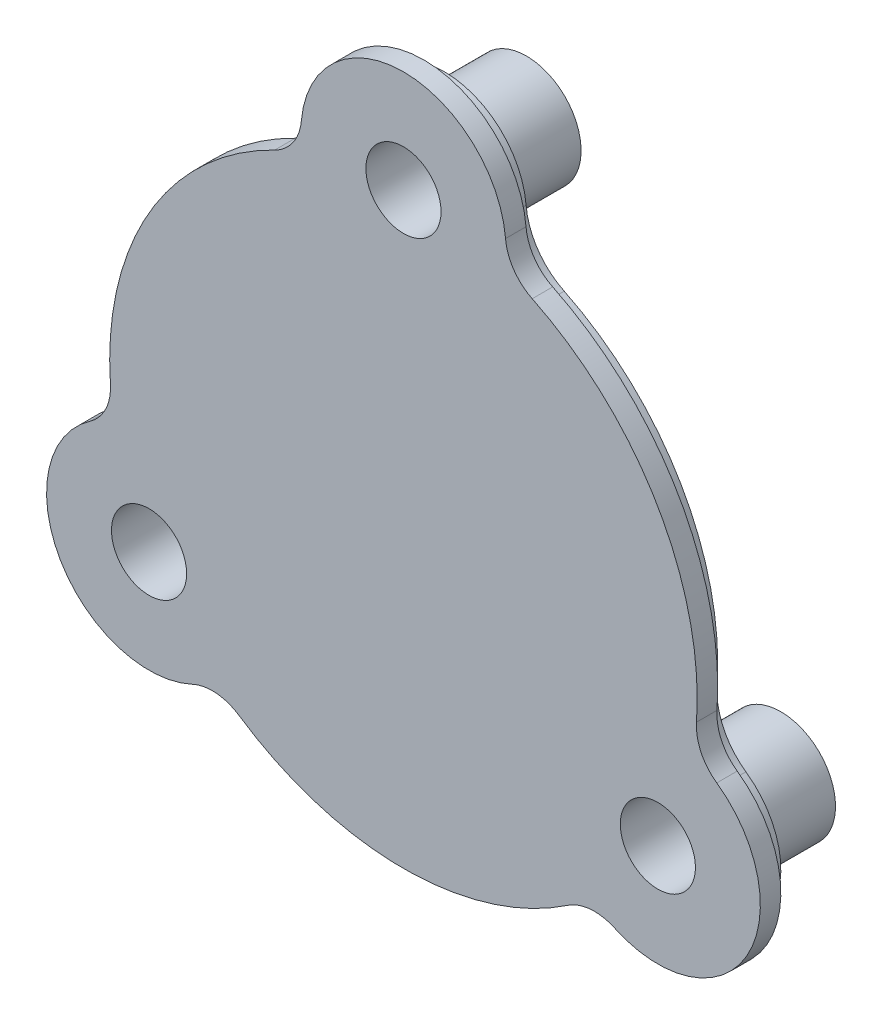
ISO-10303-21;
HEADER;
FILE_DESCRIPTION(('STEP AP214'),'2;1');
FILE_NAME('part.step','',(''),(''),'','','');
FILE_SCHEMA(('AUTOMOTIVE_DESIGN { 1 0 10303 214 1 1 1 1 }'));
ENDSEC;
DATA;
#1=APPLICATION_CONTEXT('core data for automotive mechanical design processes');
#2=APPLICATION_PROTOCOL_DEFINITION('international standard','automotive_design',2000,#1);
#3=PRODUCT_CONTEXT('',#1,'mechanical');
#4=PRODUCT('Part','Part','',(#3));
#5=PRODUCT_RELATED_PRODUCT_CATEGORY('part','',(#4));
#6=PRODUCT_DEFINITION_FORMATION('','',#4);
#7=PRODUCT_DEFINITION_CONTEXT('part definition',#1,'design');
#8=PRODUCT_DEFINITION('design','',#6,#7);
#9=PRODUCT_DEFINITION_SHAPE('','',#8);
#10=(LENGTH_UNIT() NAMED_UNIT(*) SI_UNIT(.MILLI.,.METRE.));
#11=(NAMED_UNIT(*) PLANE_ANGLE_UNIT() SI_UNIT($,.RADIAN.));
#12=(NAMED_UNIT(*) SI_UNIT($,.STERADIAN.) SOLID_ANGLE_UNIT());
#13=UNCERTAINTY_MEASURE_WITH_UNIT(LENGTH_MEASURE(1.E-05),#10,'distance_accuracy_value','');
#14=(GEOMETRIC_REPRESENTATION_CONTEXT(3) GLOBAL_UNCERTAINTY_ASSIGNED_CONTEXT((#13)) GLOBAL_UNIT_ASSIGNED_CONTEXT((#10,
#11,#12)) REPRESENTATION_CONTEXT('',''));
#15=CARTESIAN_POINT('',(0.,0.,0.));
#16=DIRECTION('',(0.,0.,1.));
#17=DIRECTION('',(1.,0.,0.));
#18=AXIS2_PLACEMENT_3D('',#15,#16,#17);
#19=CARTESIAN_POINT('',(0.,43.,-18.));
#20=DIRECTION('',(0.,0.,1.));
#21=DIRECTION('',(1.,0.,0.));
#22=AXIS2_PLACEMENT_3D('',#19,#20,#21);
#23=CYLINDRICAL_SURFACE('',#22,3.);
#24=CARTESIAN_POINT('',(0.,43.,-18.));
#25=DIRECTION('',(0.,0.,-1.));
#26=DIRECTION('',(-1.,0.,0.));
#27=AXIS2_PLACEMENT_3D('',#24,#25,#26);
#28=CIRCLE('',#27,3.);
#29=CARTESIAN_POINT('',(-3.,43.,-18.));
#30=VERTEX_POINT('',#29);
#31=EDGE_CURVE('E302',#30,#30,#28,.T.);
#32=ORIENTED_EDGE('',*,*,#31,.T.);
#33=EDGE_LOOP('',(#32));
#34=FACE_BOUND('',#33,.T.);
#35=CARTESIAN_POINT('',(0.,43.,-12.));
#36=DIRECTION('',(0.,0.,1.));
#37=DIRECTION('',(1.,0.,0.));
#38=AXIS2_PLACEMENT_3D('',#35,#36,#37);
#39=CIRCLE('',#38,3.);
#40=CARTESIAN_POINT('',(3.,43.,-12.));
#41=VERTEX_POINT('',#40);
#42=EDGE_CURVE('E49',#41,#41,#39,.T.);
#43=ORIENTED_EDGE('',*,*,#42,.T.);
#44=EDGE_LOOP('',(#43));
#45=FACE_BOUND('',#44,.T.);
#46=ADVANCED_FACE('F45',(#34,#45),#23,.F.);
#47=CARTESIAN_POINT('',(-37.2390923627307,-21.5000000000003,-18.));
#48=DIRECTION('',(0.,0.,1.));
#49=DIRECTION('',(1.,0.,0.));
#50=AXIS2_PLACEMENT_3D('',#47,#48,#49);
#51=CYLINDRICAL_SURFACE('',#50,3.);
#52=CARTESIAN_POINT('',(-37.2390923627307,-21.5000000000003,-18.));
#53=DIRECTION('',(0.,0.,-1.));
#54=DIRECTION('',(-1.,0.,0.));
#55=AXIS2_PLACEMENT_3D('',#52,#53,#54);
#56=CIRCLE('',#55,3.);
#57=CARTESIAN_POINT('',(-40.2390923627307,-21.5000000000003,-18.));
#58=VERTEX_POINT('',#57);
#59=EDGE_CURVE('E295',#58,#58,#56,.T.);
#60=ORIENTED_EDGE('',*,*,#59,.T.);
#61=EDGE_LOOP('',(#60));
#62=FACE_BOUND('',#61,.T.);
#63=CARTESIAN_POINT('',(-37.2390923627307,-21.5000000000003,-12.));
#64=DIRECTION('',(0.,0.,1.));
#65=DIRECTION('',(1.,0.,0.));
#66=AXIS2_PLACEMENT_3D('',#63,#64,#65);
#67=CIRCLE('',#66,3.);
#68=CARTESIAN_POINT('',(-34.2390923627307,-21.5000000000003,-12.));
#69=VERTEX_POINT('',#68);
#70=EDGE_CURVE('E264',#69,#69,#67,.T.);
#71=ORIENTED_EDGE('',*,*,#70,.T.);
#72=EDGE_LOOP('',(#71));
#73=FACE_BOUND('',#72,.T.);
#74=ADVANCED_FACE('F518',(#62,#73),#51,.F.);
#75=CARTESIAN_POINT('',(37.2390923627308,-21.5,-18.));
#76=DIRECTION('',(0.,0.,1.));
#77=DIRECTION('',(1.,0.,0.));
#78=AXIS2_PLACEMENT_3D('',#75,#76,#77);
#79=CYLINDRICAL_SURFACE('',#78,3.);
#80=CARTESIAN_POINT('',(37.2390923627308,-21.5,-18.));
#81=DIRECTION('',(0.,0.,-1.));
#82=DIRECTION('',(-1.,0.,0.));
#83=AXIS2_PLACEMENT_3D('',#80,#81,#82);
#84=CIRCLE('',#83,3.);
#85=CARTESIAN_POINT('',(34.2390923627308,-21.5,-18.));
#86=VERTEX_POINT('',#85);
#87=EDGE_CURVE('E283',#86,#86,#84,.T.);
#88=ORIENTED_EDGE('',*,*,#87,.T.);
#89=EDGE_LOOP('',(#88));
#90=FACE_BOUND('',#89,.T.);
#91=CARTESIAN_POINT('',(37.2390923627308,-21.5,-12.));
#92=DIRECTION('',(0.,0.,1.));
#93=DIRECTION('',(1.,0.,0.));
#94=AXIS2_PLACEMENT_3D('',#91,#92,#93);
#95=CIRCLE('',#94,3.);
#96=CARTESIAN_POINT('',(40.2390923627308,-21.5,-12.));
#97=VERTEX_POINT('',#96);
#98=EDGE_CURVE('E261',#97,#97,#95,.T.);
#99=ORIENTED_EDGE('',*,*,#98,.T.);
#100=EDGE_LOOP('',(#99));
#101=FACE_BOUND('',#100,.T.);
#102=ADVANCED_FACE('F515',(#90,#101),#79,.F.);
#103=CARTESIAN_POINT('',(-21.9141319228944,44.9418604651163,-3.));
#104=DIRECTION('',(0.,0.,1.));
#105=DIRECTION('',(1.,0.,0.));
#106=AXIS2_PLACEMENT_3D('',#103,#104,#105);
#107=CYLINDRICAL_SURFACE('',#106,7.);
#108=CARTESIAN_POINT('',(-21.9141319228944,44.9418604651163,0.));
#109=DIRECTION('',(0.,0.,-1.));
#110=DIRECTION('',(1.,0.,0.));
#111=AXIS2_PLACEMENT_3D('',#108,#109,#110);
#112=CIRCLE('',#111,7.);
#113=CARTESIAN_POINT('',(-14.9414535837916,44.3239957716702,0.));
#114=VERTEX_POINT('',#113);
#115=CARTESIAN_POINT('',(-18.8461534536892,38.65,0.));
#116=VERTEX_POINT('',#115);
#117=EDGE_CURVE('E187',#114,#116,#112,.T.);
#118=ORIENTED_EDGE('',*,*,#117,.F.);
#119=DIRECTION('',(0.,0.,1.));
#120=VECTOR('',#119,1.);
#121=CARTESIAN_POINT('',(-14.9414535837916,44.3239957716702,-3.));
#122=LINE('',#121,#120);
#123=CARTESIAN_POINT('',(-14.9414535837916,44.3239957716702,-3.));
#124=VERTEX_POINT('',#123);
#125=EDGE_CURVE('E11',#124,#114,#122,.T.);
#126=ORIENTED_EDGE('',*,*,#125,.F.);
#127=CARTESIAN_POINT('',(-21.9141319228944,44.9418604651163,-3.));
#128=DIRECTION('',(0.,0.,-1.));
#129=DIRECTION('',(1.,0.,0.));
#130=AXIS2_PLACEMENT_3D('',#127,#128,#129);
#131=CIRCLE('',#130,7.);
#132=CARTESIAN_POINT('',(-18.8461534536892,38.65,-3.));
#133=VERTEX_POINT('',#132);
#134=EDGE_CURVE('E232',#124,#133,#131,.T.);
#135=ORIENTED_EDGE('',*,*,#134,.T.);
#136=DIRECTION('',(0.,0.,1.));
#137=VECTOR('',#136,1.);
#138=CARTESIAN_POINT('',(-18.8461534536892,38.65,-3.));
#139=LINE('',#138,#137);
#140=EDGE_CURVE('E121',#133,#116,#139,.T.);
#141=ORIENTED_EDGE('',*,*,#140,.T.);
#142=EDGE_LOOP('',(#118,#126,#135,#141));
#143=FACE_BOUND('',#142,.T.);
#144=ADVANCED_FACE('F47',(#143),#107,.F.);
#145=CARTESIAN_POINT('',(0.,43.,-3.));
#146=DIRECTION('',(0.,0.,1.));
#147=DIRECTION('',(1.,0.,0.));
#148=AXIS2_PLACEMENT_3D('',#145,#146,#147);
#149=CYLINDRICAL_SURFACE('',#148,15.);
#150=CARTESIAN_POINT('',(0.,43.,0.));
#151=DIRECTION('',(0.,0.,1.));
#152=DIRECTION('',(1.,0.,0.));
#153=AXIS2_PLACEMENT_3D('',#150,#151,#152);
#154=CIRCLE('',#153,15.);
#155=CARTESIAN_POINT('',(14.9414535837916,44.3239957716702,0.));
#156=VERTEX_POINT('',#155);
#157=EDGE_CURVE('E229',#156,#114,#154,.T.);
#158=ORIENTED_EDGE('',*,*,#157,.F.);
#159=DIRECTION('',(0.,0.,1.));
#160=VECTOR('',#159,1.);
#161=CARTESIAN_POINT('',(14.9414535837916,44.3239957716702,-3.));
#162=LINE('',#161,#160);
#163=CARTESIAN_POINT('',(14.9414535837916,44.3239957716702,-3.));
#164=VERTEX_POINT('',#163);
#165=EDGE_CURVE('E55',#164,#156,#162,.T.);
#166=ORIENTED_EDGE('',*,*,#165,.F.);
#167=CARTESIAN_POINT('',(0.,43.,-3.));
#168=DIRECTION('',(0.,0.,1.));
#169=DIRECTION('',(1.,0.,0.));
#170=AXIS2_PLACEMENT_3D('',#167,#168,#169);
#171=CIRCLE('',#170,15.);
#172=EDGE_CURVE('E173',#164,#124,#171,.T.);
#173=ORIENTED_EDGE('',*,*,#172,.T.);
#174=ORIENTED_EDGE('',*,*,#125,.T.);
#175=EDGE_LOOP('',(#158,#166,#173,#174));
#176=FACE_BOUND('',#175,.T.);
#177=ADVANCED_FACE('F507',(#176),#149,.T.);
#178=CARTESIAN_POINT('',(21.9141319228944,44.9418604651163,-3.));
#179=DIRECTION('',(0.,0.,1.));
#180=DIRECTION('',(1.,0.,0.));
#181=AXIS2_PLACEMENT_3D('',#178,#179,#180);
#182=CYLINDRICAL_SURFACE('',#181,7.);
#183=CARTESIAN_POINT('',(21.9141319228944,44.9418604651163,0.));
#184=DIRECTION('',(0.,0.,-1.));
#185=DIRECTION('',(-1.,0.,0.));
#186=AXIS2_PLACEMENT_3D('',#183,#184,#185);
#187=CIRCLE('',#186,7.);
#188=CARTESIAN_POINT('',(18.8461534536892,38.65,0.));
#189=VERTEX_POINT('',#188);
#190=EDGE_CURVE('E159',#189,#156,#187,.T.);
#191=ORIENTED_EDGE('',*,*,#190,.F.);
#192=DIRECTION('',(0.,0.,1.));
#193=VECTOR('',#192,1.);
#194=CARTESIAN_POINT('',(18.8461534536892,38.65,-3.));
#195=LINE('',#194,#193);
#196=CARTESIAN_POINT('',(18.8461534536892,38.65,-3.));
#197=VERTEX_POINT('',#196);
#198=EDGE_CURVE('E153',#197,#189,#195,.T.);
#199=ORIENTED_EDGE('',*,*,#198,.F.);
#200=CARTESIAN_POINT('',(21.9141319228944,44.9418604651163,-3.));
#201=DIRECTION('',(0.,0.,-1.));
#202=DIRECTION('',(-1.,0.,0.));
#203=AXIS2_PLACEMENT_3D('',#200,#201,#202);
#204=CIRCLE('',#203,7.);
#205=EDGE_CURVE('E156',#197,#164,#204,.T.);
#206=ORIENTED_EDGE('',*,*,#205,.T.);
#207=ORIENTED_EDGE('',*,*,#165,.T.);
#208=EDGE_LOOP('',(#191,#199,#206,#207));
#209=FACE_BOUND('',#208,.T.);
#210=ADVANCED_FACE('F155',(#209),#182,.F.);
#211=CARTESIAN_POINT('',(0.,0.,-3.));
#212=DIRECTION('',(0.,0.,1.));
#213=DIRECTION('',(1.,0.,0.));
#214=AXIS2_PLACEMENT_3D('',#211,#212,#213);
#215=CYLINDRICAL_SURFACE('',#214,43.);
#216=CARTESIAN_POINT('',(0.,0.,0.));
#217=DIRECTION('',(0.,0.,1.));
#218=DIRECTION('',(1.,0.,0.));
#219=AXIS2_PLACEMENT_3D('',#216,#217,#218);
#220=CIRCLE('',#219,43.);
#221=CARTESIAN_POINT('',(42.8949585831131,-3.0037523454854,0.));
#222=VERTEX_POINT('',#221);
#223=EDGE_CURVE('E224',#222,#189,#220,.T.);
#224=ORIENTED_EDGE('',*,*,#223,.F.);
#225=DIRECTION('',(0.,0.,1.));
#226=VECTOR('',#225,1.);
#227=CARTESIAN_POINT('',(42.8949585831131,-3.0037523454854,-3.));
#228=LINE('',#227,#226);
#229=CARTESIAN_POINT('',(42.8949585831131,-3.0037523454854,-3.));
#230=VERTEX_POINT('',#229);
#231=EDGE_CURVE('E165',#230,#222,#228,.T.);
#232=ORIENTED_EDGE('',*,*,#231,.F.);
#233=CARTESIAN_POINT('',(0.,0.,-3.));
#234=DIRECTION('',(0.,0.,1.));
#235=DIRECTION('',(1.,0.,0.));
#236=AXIS2_PLACEMENT_3D('',#233,#234,#235);
#237=CIRCLE('',#236,43.);
#238=EDGE_CURVE('E171',#230,#197,#237,.T.);
#239=ORIENTED_EDGE('',*,*,#238,.T.);
#240=ORIENTED_EDGE('',*,*,#198,.T.);
#241=EDGE_LOOP('',(#224,#232,#239,#240));
#242=FACE_BOUND('',#241,.T.);
#243=ADVANCED_FACE('F176',(#242),#215,.T.);
#244=CARTESIAN_POINT('',(49.8778588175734,-3.49273528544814,-3.));
#245=DIRECTION('',(0.,0.,1.));
#246=DIRECTION('',(1.,0.,0.));
#247=AXIS2_PLACEMENT_3D('',#244,#245,#246);
#248=CYLINDRICAL_SURFACE('',#247,7.);
#249=CARTESIAN_POINT('',(49.8778588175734,-3.49273528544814,0.));
#250=DIRECTION('',(0.,0.,-1.));
#251=DIRECTION('',(-1.,0.,0.));
#252=AXIS2_PLACEMENT_3D('',#249,#250,#251);
#253=CIRCLE('',#252,7.);
#254=CARTESIAN_POINT('',(45.8564331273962,-9.22231951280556,0.));
#255=VERTEX_POINT('',#254);
#256=EDGE_CURVE('E220',#255,#222,#253,.T.);
#257=ORIENTED_EDGE('',*,*,#256,.F.);
#258=DIRECTION('',(0.,0.,1.));
#259=VECTOR('',#258,1.);
#260=CARTESIAN_POINT('',(45.8564331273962,-9.22231951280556,-3.));
#261=LINE('',#260,#259);
#262=CARTESIAN_POINT('',(45.8564331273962,-9.22231951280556,-3.));
#263=VERTEX_POINT('',#262);
#264=EDGE_CURVE('E238',#263,#255,#261,.T.);
#265=ORIENTED_EDGE('',*,*,#264,.F.);
#266=CARTESIAN_POINT('',(49.8778588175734,-3.49273528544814,-3.));
#267=DIRECTION('',(0.,0.,-1.));
#268=DIRECTION('',(-1.,0.,0.));
#269=AXIS2_PLACEMENT_3D('',#266,#267,#268);
#270=CIRCLE('',#269,7.);
#271=EDGE_CURVE('E178',#263,#230,#270,.T.);
#272=ORIENTED_EDGE('',*,*,#271,.T.);
#273=ORIENTED_EDGE('',*,*,#231,.T.);
#274=EDGE_LOOP('',(#257,#265,#272,#273));
#275=FACE_BOUND('',#274,.T.);
#276=ADVANCED_FACE('F958',(#275),#248,.F.);
#277=CARTESIAN_POINT('',(37.2390923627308,-21.5,-3.));
#278=DIRECTION('',(0.,0.,1.));
#279=DIRECTION('',(1.,0.,0.));
#280=AXIS2_PLACEMENT_3D('',#277,#278,#279);
#281=CYLINDRICAL_SURFACE('',#280,15.);
#282=CARTESIAN_POINT('',(37.2390923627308,-21.5,0.));
#283=DIRECTION('',(0.,0.,1.));
#284=DIRECTION('',(1.,0.,0.));
#285=AXIS2_PLACEMENT_3D('',#282,#283,#284);
#286=CIRCLE('',#285,15.);
#287=CARTESIAN_POINT('',(30.9149795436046,-35.1016762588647,0.));
#288=VERTEX_POINT('',#287);
#289=EDGE_CURVE('E216',#288,#255,#286,.T.);
#290=ORIENTED_EDGE('',*,*,#289,.F.);
#291=DIRECTION('',(0.,0.,1.));
#292=VECTOR('',#291,1.);
#293=CARTESIAN_POINT('',(30.9149795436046,-35.1016762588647,-3.));
#294=LINE('',#293,#292);
#295=CARTESIAN_POINT('',(30.9149795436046,-35.1016762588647,-3.));
#296=VERTEX_POINT('',#295);
#297=EDGE_CURVE('E241',#296,#288,#294,.T.);
#298=ORIENTED_EDGE('',*,*,#297,.F.);
#299=CARTESIAN_POINT('',(37.2390923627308,-21.5,-3.));
#300=DIRECTION('',(0.,0.,1.));
#301=DIRECTION('',(1.,0.,0.));
#302=AXIS2_PLACEMENT_3D('',#299,#300,#301);
#303=CIRCLE('',#302,15.);
#304=EDGE_CURVE('E181',#296,#263,#303,.T.);
#305=ORIENTED_EDGE('',*,*,#304,.T.);
#306=ORIENTED_EDGE('',*,*,#264,.T.);
#307=EDGE_LOOP('',(#290,#298,#305,#306));
#308=FACE_BOUND('',#307,.T.);
#309=ADVANCED_FACE('F482',(#308),#281,.T.);
#310=CARTESIAN_POINT('',(27.963726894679,-41.4491251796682,-3.));
#311=DIRECTION('',(0.,0.,1.));
#312=DIRECTION('',(1.,0.,0.));
#313=AXIS2_PLACEMENT_3D('',#310,#311,#312);
#314=CYLINDRICAL_SURFACE('',#313,7.);
#315=CARTESIAN_POINT('',(27.963726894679,-41.4491251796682,0.));
#316=DIRECTION('',(0.,0.,-1.));
#317=DIRECTION('',(-1.,0.,0.));
#318=AXIS2_PLACEMENT_3D('',#315,#316,#317);
#319=CIRCLE('',#318,7.);
#320=CARTESIAN_POINT('',(24.0488051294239,-35.6462476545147,0.));
#321=VERTEX_POINT('',#320);
#322=EDGE_CURVE('E212',#321,#288,#319,.T.);
#323=ORIENTED_EDGE('',*,*,#322,.F.);
#324=DIRECTION('',(0.,0.,1.));
#325=VECTOR('',#324,1.);
#326=CARTESIAN_POINT('',(24.0488051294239,-35.6462476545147,-3.));
#327=LINE('',#326,#325);
#328=CARTESIAN_POINT('',(24.0488051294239,-35.6462476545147,-3.));
#329=VERTEX_POINT('',#328);
#330=EDGE_CURVE('E244',#329,#321,#327,.T.);
#331=ORIENTED_EDGE('',*,*,#330,.F.);
#332=CARTESIAN_POINT('',(27.963726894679,-41.4491251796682,-3.));
#333=DIRECTION('',(0.,0.,-1.));
#334=DIRECTION('',(-1.,0.,0.));
#335=AXIS2_PLACEMENT_3D('',#332,#333,#334);
#336=CIRCLE('',#335,7.);
#337=EDGE_CURVE('E474',#329,#296,#336,.T.);
#338=ORIENTED_EDGE('',*,*,#337,.T.);
#339=ORIENTED_EDGE('',*,*,#297,.T.);
#340=EDGE_LOOP('',(#323,#331,#338,#339));
#341=FACE_BOUND('',#340,.T.);
#342=ADVANCED_FACE('F488',(#341),#314,.F.);
#343=CARTESIAN_POINT('',(0.,0.,-3.));
#344=DIRECTION('',(0.,0.,1.));
#345=DIRECTION('',(1.,0.,0.));
#346=AXIS2_PLACEMENT_3D('',#343,#344,#345);
#347=CYLINDRICAL_SURFACE('',#346,43.);
#348=CARTESIAN_POINT('',(0.,0.,0.));
#349=DIRECTION('',(0.,0.,1.));
#350=DIRECTION('',(1.,0.,0.));
#351=AXIS2_PLACEMENT_3D('',#348,#349,#350);
#352=CIRCLE('',#351,43.);
#353=CARTESIAN_POINT('',(-24.0488051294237,-35.6462476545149,0.));
#354=VERTEX_POINT('',#353);
#355=EDGE_CURVE('E208',#354,#321,#352,.T.);
#356=ORIENTED_EDGE('',*,*,#355,.F.);
#357=DIRECTION('',(0.,0.,1.));
#358=VECTOR('',#357,1.);
#359=CARTESIAN_POINT('',(-24.0488051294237,-35.6462476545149,-3.));
#360=LINE('',#359,#358);
#361=CARTESIAN_POINT('',(-24.0488051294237,-35.6462476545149,-3.));
#362=VERTEX_POINT('',#361);
#363=EDGE_CURVE('E247',#362,#354,#360,.T.);
#364=ORIENTED_EDGE('',*,*,#363,.F.);
#365=CARTESIAN_POINT('',(0.,0.,-3.));
#366=DIRECTION('',(0.,0.,1.));
#367=DIRECTION('',(1.,0.,0.));
#368=AXIS2_PLACEMENT_3D('',#365,#366,#367);
#369=CIRCLE('',#368,43.);
#370=EDGE_CURVE('E470',#362,#329,#369,.T.);
#371=ORIENTED_EDGE('',*,*,#370,.T.);
#372=ORIENTED_EDGE('',*,*,#330,.T.);
#373=EDGE_LOOP('',(#356,#364,#371,#372));
#374=FACE_BOUND('',#373,.T.);
#375=ADVANCED_FACE('F491',(#374),#347,.T.);
#376=CARTESIAN_POINT('',(-27.9637268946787,-41.4491251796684,-3.));
#377=DIRECTION('',(0.,0.,1.));
#378=DIRECTION('',(1.,0.,0.));
#379=AXIS2_PLACEMENT_3D('',#376,#377,#378);
#380=CYLINDRICAL_SURFACE('',#379,7.);
#381=CARTESIAN_POINT('',(-27.9637268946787,-41.4491251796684,0.));
#382=DIRECTION('',(0.,0.,-1.));
#383=DIRECTION('',(-1.,0.,0.));
#384=AXIS2_PLACEMENT_3D('',#381,#382,#383);
#385=CIRCLE('',#384,7.);
#386=CARTESIAN_POINT('',(-30.9149795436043,-35.1016762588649,0.));
#387=VERTEX_POINT('',#386);
#388=EDGE_CURVE('E204',#387,#354,#385,.T.);
#389=ORIENTED_EDGE('',*,*,#388,.F.);
#390=DIRECTION('',(0.,0.,1.));
#391=VECTOR('',#390,1.);
#392=CARTESIAN_POINT('',(-30.9149795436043,-35.1016762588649,-3.));
#393=LINE('',#392,#391);
#394=CARTESIAN_POINT('',(-30.9149795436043,-35.1016762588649,-3.));
#395=VERTEX_POINT('',#394);
#396=EDGE_CURVE('E250',#395,#387,#393,.T.);
#397=ORIENTED_EDGE('',*,*,#396,.F.);
#398=CARTESIAN_POINT('',(-27.9637268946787,-41.4491251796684,-3.));
#399=DIRECTION('',(0.,0.,-1.));
#400=DIRECTION('',(-1.,0.,0.));
#401=AXIS2_PLACEMENT_3D('',#398,#399,#400);
#402=CIRCLE('',#401,7.);
#403=EDGE_CURVE('E466',#395,#362,#402,.T.);
#404=ORIENTED_EDGE('',*,*,#403,.T.);
#405=ORIENTED_EDGE('',*,*,#363,.T.);
#406=EDGE_LOOP('',(#389,#397,#404,#405));
#407=FACE_BOUND('',#406,.T.);
#408=ADVANCED_FACE('F496',(#407),#380,.F.);
#409=CARTESIAN_POINT('',(-37.2390923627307,-21.5000000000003,-3.));
#410=DIRECTION('',(0.,0.,1.));
#411=DIRECTION('',(1.,0.,0.));
#412=AXIS2_PLACEMENT_3D('',#409,#410,#411);
#413=CYLINDRICAL_SURFACE('',#412,15.);
#414=CARTESIAN_POINT('',(-37.2390923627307,-21.5000000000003,0.));
#415=DIRECTION('',(0.,0.,1.));
#416=DIRECTION('',(1.,0.,0.));
#417=AXIS2_PLACEMENT_3D('',#414,#415,#416);
#418=CIRCLE('',#417,15.);
#419=CARTESIAN_POINT('',(-45.8564331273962,-9.2223195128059,0.));
#420=VERTEX_POINT('',#419);
#421=EDGE_CURVE('E200',#420,#387,#418,.T.);
#422=ORIENTED_EDGE('',*,*,#421,.F.);
#423=DIRECTION('',(0.,0.,1.));
#424=VECTOR('',#423,1.);
#425=CARTESIAN_POINT('',(-45.8564331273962,-9.2223195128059,-3.));
#426=LINE('',#425,#424);
#427=CARTESIAN_POINT('',(-45.8564331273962,-9.2223195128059,-3.));
#428=VERTEX_POINT('',#427);
#429=EDGE_CURVE('E253',#428,#420,#426,.T.);
#430=ORIENTED_EDGE('',*,*,#429,.F.);
#431=CARTESIAN_POINT('',(-37.2390923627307,-21.5000000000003,-3.));
#432=DIRECTION('',(0.,0.,1.));
#433=DIRECTION('',(1.,0.,0.));
#434=AXIS2_PLACEMENT_3D('',#431,#432,#433);
#435=CIRCLE('',#434,15.);
#436=EDGE_CURVE('E462',#428,#395,#435,.T.);
#437=ORIENTED_EDGE('',*,*,#436,.T.);
#438=ORIENTED_EDGE('',*,*,#396,.T.);
#439=EDGE_LOOP('',(#422,#430,#437,#438));
#440=FACE_BOUND('',#439,.T.);
#441=ADVANCED_FACE('F499',(#440),#413,.T.);
#442=CARTESIAN_POINT('',(-49.8778588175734,-3.49273528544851,-3.));
#443=DIRECTION('',(0.,0.,1.));
#444=DIRECTION('',(1.,0.,0.));
#445=AXIS2_PLACEMENT_3D('',#442,#443,#444);
#446=CYLINDRICAL_SURFACE('',#445,7.);
#447=CARTESIAN_POINT('',(-49.8778588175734,-3.49273528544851,0.));
#448=DIRECTION('',(0.,0.,-1.));
#449=DIRECTION('',(1.,0.,0.));
#450=AXIS2_PLACEMENT_3D('',#447,#448,#449);
#451=CIRCLE('',#450,7.);
#452=CARTESIAN_POINT('',(-42.8949585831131,-3.0037523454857,0.));
#453=VERTEX_POINT('',#452);
#454=EDGE_CURVE('E196',#453,#420,#451,.T.);
#455=ORIENTED_EDGE('',*,*,#454,.F.);
#456=DIRECTION('',(0.,0.,1.));
#457=VECTOR('',#456,1.);
#458=CARTESIAN_POINT('',(-42.8949585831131,-3.0037523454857,-3.));
#459=LINE('',#458,#457);
#460=CARTESIAN_POINT('',(-42.8949585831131,-3.0037523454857,-3.));
#461=VERTEX_POINT('',#460);
#462=EDGE_CURVE('E256',#461,#453,#459,.T.);
#463=ORIENTED_EDGE('',*,*,#462,.F.);
#464=CARTESIAN_POINT('',(-49.8778588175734,-3.49273528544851,-3.));
#465=DIRECTION('',(0.,0.,-1.));
#466=DIRECTION('',(1.,0.,0.));
#467=AXIS2_PLACEMENT_3D('',#464,#465,#466);
#468=CIRCLE('',#467,7.);
#469=EDGE_CURVE('E458',#461,#428,#468,.T.);
#470=ORIENTED_EDGE('',*,*,#469,.T.);
#471=ORIENTED_EDGE('',*,*,#429,.T.);
#472=EDGE_LOOP('',(#455,#463,#470,#471));
#473=FACE_BOUND('',#472,.T.);
#474=ADVANCED_FACE('F503',(#473),#446,.F.);
#475=CARTESIAN_POINT('',(0.,0.,-3.));
#476=DIRECTION('',(0.,0.,1.));
#477=DIRECTION('',(1.,0.,0.));
#478=AXIS2_PLACEMENT_3D('',#475,#476,#477);
#479=CYLINDRICAL_SURFACE('',#478,43.);
#480=CARTESIAN_POINT('',(0.,0.,0.));
#481=DIRECTION('',(0.,0.,1.));
#482=DIRECTION('',(1.,0.,0.));
#483=AXIS2_PLACEMENT_3D('',#480,#481,#482);
#484=CIRCLE('',#483,43.);
#485=EDGE_CURVE('E191',#116,#453,#484,.T.);
#486=ORIENTED_EDGE('',*,*,#485,.F.);
#487=ORIENTED_EDGE('',*,*,#140,.F.);
#488=CARTESIAN_POINT('',(0.,0.,-3.));
#489=DIRECTION('',(0.,0.,1.));
#490=DIRECTION('',(1.,0.,0.));
#491=AXIS2_PLACEMENT_3D('',#488,#489,#490);
#492=CIRCLE('',#491,43.);
#493=EDGE_CURVE('E455',#133,#461,#492,.T.);
#494=ORIENTED_EDGE('',*,*,#493,.T.);
#495=ORIENTED_EDGE('',*,*,#462,.T.);
#496=EDGE_LOOP('',(#486,#487,#494,#495));
#497=FACE_BOUND('',#496,.T.);
#498=ADVANCED_FACE('F504',(#497),#479,.T.);
#499=CARTESIAN_POINT('',(-10.9570659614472,43.9709302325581,-3.));
#500=DIRECTION('',(0.,0.,1.));
#501=DIRECTION('',(1.,0.,0.));
#502=AXIS2_PLACEMENT_3D('',#499,#500,#501);
#503=PLANE('',#502);
#504=CARTESIAN_POINT('',(0.,43.,-3.));
#505=DIRECTION('',(0.,0.,-1.));
#506=DIRECTION('',(-1.,0.,0.));
#507=AXIS2_PLACEMENT_3D('',#504,#505,#506);
#508=CIRCLE('',#507,12.);
#509=CARTESIAN_POINT('',(-11.9531628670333,44.0591966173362,-3.));
#510=VERTEX_POINT('',#509);
#511=CARTESIAN_POINT('',(11.9531628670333,44.0591966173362,-3.));
#512=VERTEX_POINT('',#511);
#513=EDGE_CURVE('E63',#510,#512,#508,.T.);
#514=ORIENTED_EDGE('',*,*,#513,.F.);
#515=CARTESIAN_POINT('',(-21.9141319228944,44.9418604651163,-3.));
#516=DIRECTION('',(0.,0.,-1.));
#517=DIRECTION('',(-1.,0.,0.));
#518=AXIS2_PLACEMENT_3D('',#515,#516,#517);
#519=CIRCLE('',#518,10.);
#520=CARTESIAN_POINT('',(-17.5313055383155,35.953488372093,-3.));
#521=VERTEX_POINT('',#520);
#522=EDGE_CURVE('E319',#510,#521,#519,.T.);
#523=ORIENTED_EDGE('',*,*,#522,.T.);
#524=CARTESIAN_POINT('',(0.,0.,-3.));
#525=DIRECTION('',(0.,0.,-1.));
#526=DIRECTION('',(-1.,0.,0.));
#527=AXIS2_PLACEMENT_3D('',#524,#525,#526);
#528=CIRCLE('',#527,40.);
#529=CARTESIAN_POINT('',(-39.9022870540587,-2.79418822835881,-3.));
#530=VERTEX_POINT('',#529);
#531=EDGE_CURVE('E402',#530,#521,#528,.T.);
#532=ORIENTED_EDGE('',*,*,#531,.F.);
#533=CARTESIAN_POINT('',(-49.8778588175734,-3.49273528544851,-3.));
#534=DIRECTION('',(0.,0.,-1.));
#535=DIRECTION('',(-1.,0.,0.));
#536=AXIS2_PLACEMENT_3D('',#533,#534,#535);
#537=CIRCLE('',#536,10.);
#538=CARTESIAN_POINT('',(-44.132964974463,-11.6778556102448,-3.));
#539=VERTEX_POINT('',#538);
#540=EDGE_CURVE('E398',#530,#539,#537,.T.);
#541=ORIENTED_EDGE('',*,*,#540,.T.);
#542=CARTESIAN_POINT('',(-37.2390923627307,-21.5000000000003,-3.));
#543=DIRECTION('',(0.,0.,-1.));
#544=DIRECTION('',(-1.,0.,0.));
#545=AXIS2_PLACEMENT_3D('',#542,#543,#544);
#546=CIRCLE('',#545,12.);
#547=CARTESIAN_POINT('',(-32.1798021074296,-32.381341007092,-3.));
#548=VERTEX_POINT('',#547);
#549=EDGE_CURVE('E394',#548,#539,#546,.T.);
#550=ORIENTED_EDGE('',*,*,#549,.F.);
#551=CARTESIAN_POINT('',(-27.9637268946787,-41.4491251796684,-3.));
#552=DIRECTION('',(0.,0.,-1.));
#553=DIRECTION('',(-1.,0.,0.));
#554=AXIS2_PLACEMENT_3D('',#551,#552,#553);
#555=CIRCLE('',#554,10.);
#556=CARTESIAN_POINT('',(-22.3709815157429,-33.1593001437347,-3.));
#557=VERTEX_POINT('',#556);
#558=EDGE_CURVE('E390',#548,#557,#555,.T.);
#559=ORIENTED_EDGE('',*,*,#558,.T.);
#560=CARTESIAN_POINT('',(0.,0.,-3.));
#561=DIRECTION('',(0.,0.,-1.));
#562=DIRECTION('',(-1.,0.,0.));
#563=AXIS2_PLACEMENT_3D('',#560,#561,#562);
#564=CIRCLE('',#563,40.);
#565=CARTESIAN_POINT('',(22.3709815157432,-33.1593001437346,-3.));
#566=VERTEX_POINT('',#565);
#567=EDGE_CURVE('E386',#566,#557,#564,.T.);
#568=ORIENTED_EDGE('',*,*,#567,.F.);
#569=CARTESIAN_POINT('',(27.963726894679,-41.4491251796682,-3.));
#570=DIRECTION('',(0.,0.,-1.));
#571=DIRECTION('',(-1.,0.,0.));
#572=AXIS2_PLACEMENT_3D('',#569,#570,#571);
#573=CIRCLE('',#572,10.);
#574=CARTESIAN_POINT('',(32.1798021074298,-32.3813410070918,-3.));
#575=VERTEX_POINT('',#574);
#576=EDGE_CURVE('E382',#566,#575,#573,.T.);
#577=ORIENTED_EDGE('',*,*,#576,.T.);
#578=CARTESIAN_POINT('',(37.2390923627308,-21.5,-3.));
#579=DIRECTION('',(0.,0.,-1.));
#580=DIRECTION('',(-1.,0.,0.));
#581=AXIS2_PLACEMENT_3D('',#578,#579,#580);
#582=CIRCLE('',#581,12.);
#583=CARTESIAN_POINT('',(44.1329649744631,-11.6778556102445,-3.));
#584=VERTEX_POINT('',#583);
#585=EDGE_CURVE('E378',#584,#575,#582,.T.);
#586=ORIENTED_EDGE('',*,*,#585,.F.);
#587=CARTESIAN_POINT('',(49.8778588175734,-3.49273528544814,-3.));
#588=DIRECTION('',(0.,0.,-1.));
#589=DIRECTION('',(-1.,0.,0.));
#590=AXIS2_PLACEMENT_3D('',#587,#588,#589);
#591=CIRCLE('',#590,9.99999999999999);
#592=CARTESIAN_POINT('',(39.9022870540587,-2.79418822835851,-3.));
#593=VERTEX_POINT('',#592);
#594=EDGE_CURVE('E374',#584,#593,#591,.T.);
#595=ORIENTED_EDGE('',*,*,#594,.T.);
#596=CARTESIAN_POINT('',(0.,0.,-3.));
#597=DIRECTION('',(0.,0.,-1.));
#598=DIRECTION('',(-1.,0.,0.));
#599=AXIS2_PLACEMENT_3D('',#596,#597,#598);
#600=CIRCLE('',#599,40.);
#601=CARTESIAN_POINT('',(17.5313055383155,35.953488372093,-3.));
#602=VERTEX_POINT('',#601);
#603=EDGE_CURVE('E370',#602,#593,#600,.T.);
#604=ORIENTED_EDGE('',*,*,#603,.F.);
#605=CARTESIAN_POINT('',(21.9141319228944,44.9418604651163,-3.));
#606=DIRECTION('',(0.,0.,-1.));
#607=DIRECTION('',(-1.,0.,0.));
#608=AXIS2_PLACEMENT_3D('',#605,#606,#607);
#609=CIRCLE('',#608,10.);
#610=EDGE_CURVE('E366',#602,#512,#609,.T.);
#611=ORIENTED_EDGE('',*,*,#610,.T.);
#612=EDGE_LOOP('',(#514,#523,#532,#541,#550,#559,#568,#577,#586,#595,#604,#611));
#613=FACE_BOUND('',#612,.T.);
#614=ORIENTED_EDGE('',*,*,#134,.F.);
#615=ORIENTED_EDGE('',*,*,#172,.F.);
#616=ORIENTED_EDGE('',*,*,#205,.F.);
#617=ORIENTED_EDGE('',*,*,#238,.F.);
#618=ORIENTED_EDGE('',*,*,#271,.F.);
#619=ORIENTED_EDGE('',*,*,#304,.F.);
#620=ORIENTED_EDGE('',*,*,#337,.F.);
#621=ORIENTED_EDGE('',*,*,#370,.F.);
#622=ORIENTED_EDGE('',*,*,#403,.F.);
#623=ORIENTED_EDGE('',*,*,#436,.F.);
#624=ORIENTED_EDGE('',*,*,#469,.F.);
#625=ORIENTED_EDGE('',*,*,#493,.F.);
#626=EDGE_LOOP('',(#614,#615,#616,#617,#618,#619,#620,#621,#622,#623,#624,#625));
#627=FACE_BOUND('',#626,.T.);
#628=ADVANCED_FACE('F169',(#613,#627),#503,.F.);
#629=CARTESIAN_POINT('',(-10.9570659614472,43.9709302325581,0.));
#630=DIRECTION('',(0.,0.,1.));
#631=DIRECTION('',(1.,0.,0.));
#632=AXIS2_PLACEMENT_3D('',#629,#630,#631);
#633=PLANE('',#632);
#634=CARTESIAN_POINT('',(0.,43.,0.));
#635=DIRECTION('',(0.,0.,1.));
#636=DIRECTION('',(1.,0.,0.));
#637=AXIS2_PLACEMENT_3D('',#634,#635,#636);
#638=CIRCLE('',#637,5.5);
#639=CARTESIAN_POINT('',(5.5,43.,0.));
#640=VERTEX_POINT('',#639);
#641=EDGE_CURVE('E600',#640,#640,#638,.T.);
#642=ORIENTED_EDGE('',*,*,#641,.F.);
#643=EDGE_LOOP('',(#642));
#644=FACE_BOUND('',#643,.T.);
#645=CARTESIAN_POINT('',(37.2390923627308,-21.5,0.));
#646=DIRECTION('',(0.,0.,1.));
#647=DIRECTION('',(1.,0.,0.));
#648=AXIS2_PLACEMENT_3D('',#645,#646,#647);
#649=CIRCLE('',#648,5.5);
#650=CARTESIAN_POINT('',(42.7390923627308,-21.5,0.));
#651=VERTEX_POINT('',#650);
#652=EDGE_CURVE('E604',#651,#651,#649,.T.);
#653=ORIENTED_EDGE('',*,*,#652,.F.);
#654=EDGE_LOOP('',(#653));
#655=FACE_BOUND('',#654,.T.);
#656=CARTESIAN_POINT('',(-37.2390923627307,-21.5000000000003,0.));
#657=DIRECTION('',(0.,0.,1.));
#658=DIRECTION('',(1.,0.,0.));
#659=AXIS2_PLACEMENT_3D('',#656,#657,#658);
#660=CIRCLE('',#659,5.5);
#661=CARTESIAN_POINT('',(-31.7390923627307,-21.5000000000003,0.));
#662=VERTEX_POINT('',#661);
#663=EDGE_CURVE('E607',#662,#662,#660,.T.);
#664=ORIENTED_EDGE('',*,*,#663,.F.);
#665=EDGE_LOOP('',(#664));
#666=FACE_BOUND('',#665,.T.);
#667=ORIENTED_EDGE('',*,*,#117,.T.);
#668=ORIENTED_EDGE('',*,*,#485,.T.);
#669=ORIENTED_EDGE('',*,*,#454,.T.);
#670=ORIENTED_EDGE('',*,*,#421,.T.);
#671=ORIENTED_EDGE('',*,*,#388,.T.);
#672=ORIENTED_EDGE('',*,*,#355,.T.);
#673=ORIENTED_EDGE('',*,*,#322,.T.);
#674=ORIENTED_EDGE('',*,*,#289,.T.);
#675=ORIENTED_EDGE('',*,*,#256,.T.);
#676=ORIENTED_EDGE('',*,*,#223,.T.);
#677=ORIENTED_EDGE('',*,*,#190,.T.);
#678=ORIENTED_EDGE('',*,*,#157,.T.);
#679=EDGE_LOOP('',(#667,#668,#669,#670,#671,#672,#673,#674,#675,#676,#677,#678));
#680=FACE_BOUND('',#679,.T.);
#681=ADVANCED_FACE('F506',(#644,#655,#666,#680),#633,.T.);
#682=CARTESIAN_POINT('',(0.,43.,-6.));
#683=DIRECTION('',(0.,0.,1.));
#684=DIRECTION('',(1.,0.,0.));
#685=AXIS2_PLACEMENT_3D('',#682,#683,#684);
#686=CYLINDRICAL_SURFACE('',#685,12.);
#687=ORIENTED_EDGE('',*,*,#513,.T.);
#688=DIRECTION('',(0.,0.,1.));
#689=VECTOR('',#688,1.);
#690=CARTESIAN_POINT('',(11.9531628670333,44.0591966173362,-6.));
#691=LINE('',#690,#689);
#692=CARTESIAN_POINT('',(11.9531628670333,44.0591966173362,-6.));
#693=VERTEX_POINT('',#692);
#694=EDGE_CURVE('E192',#693,#512,#691,.T.);
#695=ORIENTED_EDGE('',*,*,#694,.F.);
#696=CARTESIAN_POINT('',(0.,43.,-6.));
#697=DIRECTION('',(0.,0.,-1.));
#698=DIRECTION('',(-1.,0.,0.));
#699=AXIS2_PLACEMENT_3D('',#696,#697,#698);
#700=CIRCLE('',#699,12.);
#701=CARTESIAN_POINT('',(-11.9531628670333,44.0591966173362,-6.));
#702=VERTEX_POINT('',#701);
#703=EDGE_CURVE('E314',#702,#693,#700,.T.);
#704=ORIENTED_EDGE('',*,*,#703,.F.);
#705=DIRECTION('',(0.,0.,1.));
#706=VECTOR('',#705,1.);
#707=CARTESIAN_POINT('',(-11.9531628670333,44.0591966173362,-6.));
#708=LINE('',#707,#706);
#709=EDGE_CURVE('E363',#702,#510,#708,.T.);
#710=ORIENTED_EDGE('',*,*,#709,.T.);
#711=EDGE_LOOP('',(#687,#695,#704,#710));
#712=FACE_BOUND('',#711,.T.);
#713=ADVANCED_FACE('F585',(#712),#686,.T.);
#714=CARTESIAN_POINT('',(21.9141319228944,44.9418604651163,-6.));
#715=DIRECTION('',(0.,0.,1.));
#716=DIRECTION('',(1.,0.,0.));
#717=AXIS2_PLACEMENT_3D('',#714,#715,#716);
#718=CYLINDRICAL_SURFACE('',#717,10.);
#719=ORIENTED_EDGE('',*,*,#610,.F.);
#720=DIRECTION('',(0.,0.,1.));
#721=VECTOR('',#720,1.);
#722=CARTESIAN_POINT('',(17.5313055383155,35.953488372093,-6.));
#723=LINE('',#722,#721);
#724=CARTESIAN_POINT('',(17.5313055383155,35.953488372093,-6.));
#725=VERTEX_POINT('',#724);
#726=EDGE_CURVE('E447',#725,#602,#723,.T.);
#727=ORIENTED_EDGE('',*,*,#726,.F.);
#728=CARTESIAN_POINT('',(21.9141319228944,44.9418604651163,-6.));
#729=DIRECTION('',(0.,0.,-1.));
#730=DIRECTION('',(-1.,0.,0.));
#731=AXIS2_PLACEMENT_3D('',#728,#729,#730);
#732=CIRCLE('',#731,10.);
#733=EDGE_CURVE('E318',#725,#693,#732,.T.);
#734=ORIENTED_EDGE('',*,*,#733,.T.);
#735=ORIENTED_EDGE('',*,*,#694,.T.);
#736=EDGE_LOOP('',(#719,#727,#734,#735));
#737=FACE_BOUND('',#736,.T.);
#738=ADVANCED_FACE('F581',(#737),#718,.F.);
#739=CARTESIAN_POINT('',(0.,0.,-6.));
#740=DIRECTION('',(0.,0.,1.));
#741=DIRECTION('',(1.,0.,0.));
#742=AXIS2_PLACEMENT_3D('',#739,#740,#741);
#743=CYLINDRICAL_SURFACE('',#742,40.);
#744=ORIENTED_EDGE('',*,*,#603,.T.);
#745=DIRECTION('',(0.,0.,1.));
#746=VECTOR('',#745,1.);
#747=CARTESIAN_POINT('',(39.9022870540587,-2.79418822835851,-6.));
#748=LINE('',#747,#746);
#749=CARTESIAN_POINT('',(39.9022870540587,-2.79418822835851,-6.));
#750=VERTEX_POINT('',#749);
#751=EDGE_CURVE('E443',#750,#593,#748,.T.);
#752=ORIENTED_EDGE('',*,*,#751,.F.);
#753=CARTESIAN_POINT('',(0.,0.,-6.));
#754=DIRECTION('',(0.,0.,-1.));
#755=DIRECTION('',(-1.,0.,0.));
#756=AXIS2_PLACEMENT_3D('',#753,#754,#755);
#757=CIRCLE('',#756,40.);
#758=EDGE_CURVE('E323',#725,#750,#757,.T.);
#759=ORIENTED_EDGE('',*,*,#758,.F.);
#760=ORIENTED_EDGE('',*,*,#726,.T.);
#761=EDGE_LOOP('',(#744,#752,#759,#760));
#762=FACE_BOUND('',#761,.T.);
#763=ADVANCED_FACE('F577',(#762),#743,.T.);
#764=CARTESIAN_POINT('',(49.8778588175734,-3.49273528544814,-6.));
#765=DIRECTION('',(0.,0.,1.));
#766=DIRECTION('',(1.,0.,0.));
#767=AXIS2_PLACEMENT_3D('',#764,#765,#766);
#768=CYLINDRICAL_SURFACE('',#767,9.99999999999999);
#769=ORIENTED_EDGE('',*,*,#594,.F.);
#770=DIRECTION('',(0.,0.,1.));
#771=VECTOR('',#770,1.);
#772=CARTESIAN_POINT('',(44.1329649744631,-11.6778556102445,-6.));
#773=LINE('',#772,#771);
#774=CARTESIAN_POINT('',(44.1329649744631,-11.6778556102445,-6.));
#775=VERTEX_POINT('',#774);
#776=EDGE_CURVE('E439',#775,#584,#773,.T.);
#777=ORIENTED_EDGE('',*,*,#776,.F.);
#778=CARTESIAN_POINT('',(49.8778588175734,-3.49273528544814,-6.));
#779=DIRECTION('',(0.,0.,-1.));
#780=DIRECTION('',(-1.,0.,0.));
#781=AXIS2_PLACEMENT_3D('',#778,#779,#780);
#782=CIRCLE('',#781,9.99999999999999);
#783=EDGE_CURVE('E327',#775,#750,#782,.T.);
#784=ORIENTED_EDGE('',*,*,#783,.T.);
#785=ORIENTED_EDGE('',*,*,#751,.T.);
#786=EDGE_LOOP('',(#769,#777,#784,#785));
#787=FACE_BOUND('',#786,.T.);
#788=ADVANCED_FACE('F573',(#787),#768,.F.);
#789=CARTESIAN_POINT('',(37.2390923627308,-21.5,-6.));
#790=DIRECTION('',(0.,0.,1.));
#791=DIRECTION('',(1.,0.,0.));
#792=AXIS2_PLACEMENT_3D('',#789,#790,#791);
#793=CYLINDRICAL_SURFACE('',#792,12.);
#794=ORIENTED_EDGE('',*,*,#585,.T.);
#795=DIRECTION('',(0.,0.,1.));
#796=VECTOR('',#795,1.);
#797=CARTESIAN_POINT('',(32.1798021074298,-32.3813410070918,-6.));
#798=LINE('',#797,#796);
#799=CARTESIAN_POINT('',(32.1798021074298,-32.3813410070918,-6.));
#800=VERTEX_POINT('',#799);
#801=EDGE_CURVE('E435',#800,#575,#798,.T.);
#802=ORIENTED_EDGE('',*,*,#801,.F.);
#803=CARTESIAN_POINT('',(37.2390923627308,-21.5,-6.));
#804=DIRECTION('',(0.,0.,-1.));
#805=DIRECTION('',(-1.,0.,0.));
#806=AXIS2_PLACEMENT_3D('',#803,#804,#805);
#807=CIRCLE('',#806,12.);
#808=EDGE_CURVE('E331',#775,#800,#807,.T.);
#809=ORIENTED_EDGE('',*,*,#808,.F.);
#810=ORIENTED_EDGE('',*,*,#776,.T.);
#811=EDGE_LOOP('',(#794,#802,#809,#810));
#812=FACE_BOUND('',#811,.T.);
#813=ADVANCED_FACE('F569',(#812),#793,.T.);
#814=CARTESIAN_POINT('',(27.963726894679,-41.4491251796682,-6.));
#815=DIRECTION('',(0.,0.,1.));
#816=DIRECTION('',(1.,0.,0.));
#817=AXIS2_PLACEMENT_3D('',#814,#815,#816);
#818=CYLINDRICAL_SURFACE('',#817,10.);
#819=ORIENTED_EDGE('',*,*,#576,.F.);
#820=DIRECTION('',(0.,0.,1.));
#821=VECTOR('',#820,1.);
#822=CARTESIAN_POINT('',(22.3709815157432,-33.1593001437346,-6.));
#823=LINE('',#822,#821);
#824=CARTESIAN_POINT('',(22.3709815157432,-33.1593001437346,-6.));
#825=VERTEX_POINT('',#824);
#826=EDGE_CURVE('E431',#825,#566,#823,.T.);
#827=ORIENTED_EDGE('',*,*,#826,.F.);
#828=CARTESIAN_POINT('',(27.963726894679,-41.4491251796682,-6.));
#829=DIRECTION('',(0.,0.,-1.));
#830=DIRECTION('',(-1.,0.,0.));
#831=AXIS2_PLACEMENT_3D('',#828,#829,#830);
#832=CIRCLE('',#831,10.);
#833=EDGE_CURVE('E335',#825,#800,#832,.T.);
#834=ORIENTED_EDGE('',*,*,#833,.T.);
#835=ORIENTED_EDGE('',*,*,#801,.T.);
#836=EDGE_LOOP('',(#819,#827,#834,#835));
#837=FACE_BOUND('',#836,.T.);
#838=ADVANCED_FACE('F565',(#837),#818,.F.);
#839=CARTESIAN_POINT('',(0.,0.,-6.));
#840=DIRECTION('',(0.,0.,1.));
#841=DIRECTION('',(1.,0.,0.));
#842=AXIS2_PLACEMENT_3D('',#839,#840,#841);
#843=CYLINDRICAL_SURFACE('',#842,40.);
#844=ORIENTED_EDGE('',*,*,#567,.T.);
#845=DIRECTION('',(0.,0.,1.));
#846=VECTOR('',#845,1.);
#847=CARTESIAN_POINT('',(-22.3709815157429,-33.1593001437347,-6.));
#848=LINE('',#847,#846);
#849=CARTESIAN_POINT('',(-22.3709815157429,-33.1593001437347,-6.));
#850=VERTEX_POINT('',#849);
#851=EDGE_CURVE('E427',#850,#557,#848,.T.);
#852=ORIENTED_EDGE('',*,*,#851,.F.);
#853=CARTESIAN_POINT('',(0.,0.,-6.));
#854=DIRECTION('',(0.,0.,-1.));
#855=DIRECTION('',(-1.,0.,0.));
#856=AXIS2_PLACEMENT_3D('',#853,#854,#855);
#857=CIRCLE('',#856,40.);
#858=EDGE_CURVE('E339',#825,#850,#857,.T.);
#859=ORIENTED_EDGE('',*,*,#858,.F.);
#860=ORIENTED_EDGE('',*,*,#826,.T.);
#861=EDGE_LOOP('',(#844,#852,#859,#860));
#862=FACE_BOUND('',#861,.T.);
#863=ADVANCED_FACE('F561',(#862),#843,.T.);
#864=CARTESIAN_POINT('',(-27.9637268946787,-41.4491251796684,-6.));
#865=DIRECTION('',(0.,0.,1.));
#866=DIRECTION('',(1.,0.,0.));
#867=AXIS2_PLACEMENT_3D('',#864,#865,#866);
#868=CYLINDRICAL_SURFACE('',#867,10.);
#869=ORIENTED_EDGE('',*,*,#558,.F.);
#870=DIRECTION('',(0.,0.,1.));
#871=VECTOR('',#870,1.);
#872=CARTESIAN_POINT('',(-32.1798021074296,-32.381341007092,-6.));
#873=LINE('',#872,#871);
#874=CARTESIAN_POINT('',(-32.1798021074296,-32.381341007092,-6.));
#875=VERTEX_POINT('',#874);
#876=EDGE_CURVE('E423',#875,#548,#873,.T.);
#877=ORIENTED_EDGE('',*,*,#876,.F.);
#878=CARTESIAN_POINT('',(-27.9637268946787,-41.4491251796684,-6.));
#879=DIRECTION('',(0.,0.,-1.));
#880=DIRECTION('',(-1.,0.,0.));
#881=AXIS2_PLACEMENT_3D('',#878,#879,#880);
#882=CIRCLE('',#881,10.);
#883=EDGE_CURVE('E343',#875,#850,#882,.T.);
#884=ORIENTED_EDGE('',*,*,#883,.T.);
#885=ORIENTED_EDGE('',*,*,#851,.T.);
#886=EDGE_LOOP('',(#869,#877,#884,#885));
#887=FACE_BOUND('',#886,.T.);
#888=ADVANCED_FACE('F557',(#887),#868,.F.);
#889=CARTESIAN_POINT('',(-37.2390923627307,-21.5000000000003,-6.));
#890=DIRECTION('',(0.,0.,1.));
#891=DIRECTION('',(1.,0.,0.));
#892=AXIS2_PLACEMENT_3D('',#889,#890,#891);
#893=CYLINDRICAL_SURFACE('',#892,12.);
#894=ORIENTED_EDGE('',*,*,#549,.T.);
#895=DIRECTION('',(0.,0.,1.));
#896=VECTOR('',#895,1.);
#897=CARTESIAN_POINT('',(-44.132964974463,-11.6778556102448,-6.));
#898=LINE('',#897,#896);
#899=CARTESIAN_POINT('',(-44.132964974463,-11.6778556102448,-6.));
#900=VERTEX_POINT('',#899);
#901=EDGE_CURVE('E419',#900,#539,#898,.T.);
#902=ORIENTED_EDGE('',*,*,#901,.F.);
#903=CARTESIAN_POINT('',(-37.2390923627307,-21.5000000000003,-6.));
#904=DIRECTION('',(0.,0.,-1.));
#905=DIRECTION('',(-1.,0.,0.));
#906=AXIS2_PLACEMENT_3D('',#903,#904,#905);
#907=CIRCLE('',#906,12.);
#908=EDGE_CURVE('E347',#875,#900,#907,.T.);
#909=ORIENTED_EDGE('',*,*,#908,.F.);
#910=ORIENTED_EDGE('',*,*,#876,.T.);
#911=EDGE_LOOP('',(#894,#902,#909,#910));
#912=FACE_BOUND('',#911,.T.);
#913=ADVANCED_FACE('F553',(#912),#893,.T.);
#914=CARTESIAN_POINT('',(-49.8778588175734,-3.49273528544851,-6.));
#915=DIRECTION('',(0.,0.,1.));
#916=DIRECTION('',(1.,0.,0.));
#917=AXIS2_PLACEMENT_3D('',#914,#915,#916);
#918=CYLINDRICAL_SURFACE('',#917,10.);
#919=ORIENTED_EDGE('',*,*,#540,.F.);
#920=DIRECTION('',(0.,0.,1.));
#921=VECTOR('',#920,1.);
#922=CARTESIAN_POINT('',(-39.9022870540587,-2.79418822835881,-6.));
#923=LINE('',#922,#921);
#924=CARTESIAN_POINT('',(-39.9022870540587,-2.79418822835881,-6.));
#925=VERTEX_POINT('',#924);
#926=EDGE_CURVE('E415',#925,#530,#923,.T.);
#927=ORIENTED_EDGE('',*,*,#926,.F.);
#928=CARTESIAN_POINT('',(-49.8778588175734,-3.49273528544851,-6.));
#929=DIRECTION('',(0.,0.,-1.));
#930=DIRECTION('',(-1.,0.,0.));
#931=AXIS2_PLACEMENT_3D('',#928,#929,#930);
#932=CIRCLE('',#931,10.);
#933=EDGE_CURVE('E351',#925,#900,#932,.T.);
#934=ORIENTED_EDGE('',*,*,#933,.T.);
#935=ORIENTED_EDGE('',*,*,#901,.T.);
#936=EDGE_LOOP('',(#919,#927,#934,#935));
#937=FACE_BOUND('',#936,.T.);
#938=ADVANCED_FACE('F549',(#937),#918,.F.);
#939=CARTESIAN_POINT('',(0.,0.,-6.));
#940=DIRECTION('',(0.,0.,1.));
#941=DIRECTION('',(1.,0.,0.));
#942=AXIS2_PLACEMENT_3D('',#939,#940,#941);
#943=CYLINDRICAL_SURFACE('',#942,40.);
#944=ORIENTED_EDGE('',*,*,#531,.T.);
#945=DIRECTION('',(0.,0.,1.));
#946=VECTOR('',#945,1.);
#947=CARTESIAN_POINT('',(-17.5313055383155,35.953488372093,-6.));
#948=LINE('',#947,#946);
#949=CARTESIAN_POINT('',(-17.5313055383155,35.953488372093,-6.));
#950=VERTEX_POINT('',#949);
#951=EDGE_CURVE('E411',#950,#521,#948,.T.);
#952=ORIENTED_EDGE('',*,*,#951,.F.);
#953=CARTESIAN_POINT('',(0.,0.,-6.));
#954=DIRECTION('',(0.,0.,-1.));
#955=DIRECTION('',(-1.,0.,0.));
#956=AXIS2_PLACEMENT_3D('',#953,#954,#955);
#957=CIRCLE('',#956,40.);
#958=EDGE_CURVE('E355',#925,#950,#957,.T.);
#959=ORIENTED_EDGE('',*,*,#958,.F.);
#960=ORIENTED_EDGE('',*,*,#926,.T.);
#961=EDGE_LOOP('',(#944,#952,#959,#960));
#962=FACE_BOUND('',#961,.T.);
#963=ADVANCED_FACE('F545',(#962),#943,.T.);
#964=CARTESIAN_POINT('',(-21.9141319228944,44.9418604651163,-6.));
#965=DIRECTION('',(0.,0.,1.));
#966=DIRECTION('',(1.,0.,0.));
#967=AXIS2_PLACEMENT_3D('',#964,#965,#966);
#968=CYLINDRICAL_SURFACE('',#967,10.);
#969=ORIENTED_EDGE('',*,*,#522,.F.);
#970=ORIENTED_EDGE('',*,*,#709,.F.);
#971=CARTESIAN_POINT('',(-21.9141319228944,44.9418604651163,-6.));
#972=DIRECTION('',(0.,0.,-1.));
#973=DIRECTION('',(-1.,0.,0.));
#974=AXIS2_PLACEMENT_3D('',#971,#972,#973);
#975=CIRCLE('',#974,10.);
#976=EDGE_CURVE('E359',#702,#950,#975,.T.);
#977=ORIENTED_EDGE('',*,*,#976,.T.);
#978=ORIENTED_EDGE('',*,*,#951,.T.);
#979=EDGE_LOOP('',(#969,#970,#977,#978));
#980=FACE_BOUND('',#979,.T.);
#981=ADVANCED_FACE('F541',(#980),#968,.F.);
#982=CARTESIAN_POINT('',(10.9570659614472,43.9709302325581,-6.));
#983=DIRECTION('',(0.,0.,-1.));
#984=DIRECTION('',(-1.,0.,0.));
#985=AXIS2_PLACEMENT_3D('',#982,#983,#984);
#986=PLANE('',#985);
#987=CARTESIAN_POINT('',(37.2390923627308,-21.5,-6.));
#988=DIRECTION('',(0.,0.,-1.));
#989=DIRECTION('',(-1.,0.,0.));
#990=AXIS2_PLACEMENT_3D('',#987,#988,#989);
#991=CIRCLE('',#990,8.);
#992=CARTESIAN_POINT('',(29.2390923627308,-21.5,-6.));
#993=VERTEX_POINT('',#992);
#994=EDGE_CURVE('E277',#993,#993,#991,.T.);
#995=ORIENTED_EDGE('',*,*,#994,.F.);
#996=EDGE_LOOP('',(#995));
#997=FACE_BOUND('',#996,.T.);
#998=CARTESIAN_POINT('',(-37.2390923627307,-21.5000000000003,-6.));
#999=DIRECTION('',(0.,0.,-1.));
#1000=DIRECTION('',(-1.,0.,0.));
#1001=AXIS2_PLACEMENT_3D('',#998,#999,#1000);
#1002=CIRCLE('',#1001,8.);
#1003=CARTESIAN_POINT('',(-45.2390923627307,-21.5000000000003,-6.));
#1004=VERTEX_POINT('',#1003);
#1005=EDGE_CURVE('E291',#1004,#1004,#1002,.T.);
#1006=ORIENTED_EDGE('',*,*,#1005,.F.);
#1007=EDGE_LOOP('',(#1006));
#1008=FACE_BOUND('',#1007,.T.);
#1009=CARTESIAN_POINT('',(0.,43.,-6.));
#1010=DIRECTION('',(0.,0.,-1.));
#1011=DIRECTION('',(-1.,0.,0.));
#1012=AXIS2_PLACEMENT_3D('',#1009,#1010,#1011);
#1013=CIRCLE('',#1012,8.);
#1014=CARTESIAN_POINT('',(-8.,43.,-6.));
#1015=VERTEX_POINT('',#1014);
#1016=EDGE_CURVE('E306',#1015,#1015,#1013,.T.);
#1017=ORIENTED_EDGE('',*,*,#1016,.F.);
#1018=EDGE_LOOP('',(#1017));
#1019=FACE_BOUND('',#1018,.T.);
#1020=ORIENTED_EDGE('',*,*,#703,.T.);
#1021=ORIENTED_EDGE('',*,*,#733,.F.);
#1022=ORIENTED_EDGE('',*,*,#758,.T.);
#1023=ORIENTED_EDGE('',*,*,#783,.F.);
#1024=ORIENTED_EDGE('',*,*,#808,.T.);
#1025=ORIENTED_EDGE('',*,*,#833,.F.);
#1026=ORIENTED_EDGE('',*,*,#858,.T.);
#1027=ORIENTED_EDGE('',*,*,#883,.F.);
#1028=ORIENTED_EDGE('',*,*,#908,.T.);
#1029=ORIENTED_EDGE('',*,*,#933,.F.);
#1030=ORIENTED_EDGE('',*,*,#958,.T.);
#1031=ORIENTED_EDGE('',*,*,#976,.F.);
#1032=EDGE_LOOP('',(#1020,#1021,#1022,#1023,#1024,#1025,#1026,#1027,#1028,#1029,#1030,#1031));
#1033=FACE_BOUND('',#1032,.T.);
#1034=ADVANCED_FACE('F533',(#997,#1008,#1019,#1033),#986,.T.);
#1035=CARTESIAN_POINT('',(0.,43.,-18.));
#1036=DIRECTION('',(0.,0.,-1.));
#1037=DIRECTION('',(-1.,0.,0.));
#1038=AXIS2_PLACEMENT_3D('',#1035,#1036,#1037);
#1039=PLANE('',#1038);
#1040=CARTESIAN_POINT('',(0.,43.,-18.));
#1041=DIRECTION('',(0.,0.,-1.));
#1042=DIRECTION('',(-1.,0.,0.));
#1043=AXIS2_PLACEMENT_3D('',#1040,#1041,#1042);
#1044=CIRCLE('',#1043,8.);
#1045=CARTESIAN_POINT('',(-8.,43.,-18.));
#1046=VERTEX_POINT('',#1045);
#1047=EDGE_CURVE('E307',#1046,#1046,#1044,.T.);
#1048=ORIENTED_EDGE('',*,*,#1047,.T.);
#1049=EDGE_LOOP('',(#1048));
#1050=FACE_BOUND('',#1049,.T.);
#1051=ORIENTED_EDGE('',*,*,#31,.F.);
#1052=EDGE_LOOP('',(#1051));
#1053=FACE_BOUND('',#1052,.T.);
#1054=ADVANCED_FACE('F529',(#1050,#1053),#1039,.T.);
#1055=CARTESIAN_POINT('',(0.,43.,-18.));
#1056=DIRECTION('',(0.,0.,1.));
#1057=DIRECTION('',(1.,0.,0.));
#1058=AXIS2_PLACEMENT_3D('',#1055,#1056,#1057);
#1059=CYLINDRICAL_SURFACE('',#1058,8.);
#1060=ORIENTED_EDGE('',*,*,#1047,.F.);
#1061=EDGE_LOOP('',(#1060));
#1062=FACE_BOUND('',#1061,.T.);
#1063=ORIENTED_EDGE('',*,*,#1016,.T.);
#1064=EDGE_LOOP('',(#1063));
#1065=FACE_BOUND('',#1064,.T.);
#1066=ADVANCED_FACE('F532',(#1062,#1065),#1059,.T.);
#1067=CARTESIAN_POINT('',(-37.2390923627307,-21.5000000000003,-18.));
#1068=DIRECTION('',(0.,0.,-1.));
#1069=DIRECTION('',(-1.,0.,0.));
#1070=AXIS2_PLACEMENT_3D('',#1067,#1068,#1069);
#1071=PLANE('',#1070);
#1072=CARTESIAN_POINT('',(-37.2390923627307,-21.5000000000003,-18.));
#1073=DIRECTION('',(0.,0.,-1.));
#1074=DIRECTION('',(-1.,0.,0.));
#1075=AXIS2_PLACEMENT_3D('',#1072,#1073,#1074);
#1076=CIRCLE('',#1075,8.);
#1077=CARTESIAN_POINT('',(-45.2390923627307,-21.5000000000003,-18.));
#1078=VERTEX_POINT('',#1077);
#1079=EDGE_CURVE('E290',#1078,#1078,#1076,.T.);
#1080=ORIENTED_EDGE('',*,*,#1079,.T.);
#1081=EDGE_LOOP('',(#1080));
#1082=FACE_BOUND('',#1081,.T.);
#1083=ORIENTED_EDGE('',*,*,#59,.F.);
#1084=EDGE_LOOP('',(#1083));
#1085=FACE_BOUND('',#1084,.T.);
#1086=ADVANCED_FACE('F537',(#1082,#1085),#1071,.T.);
#1087=CARTESIAN_POINT('',(-37.2390923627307,-21.5000000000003,-18.));
#1088=DIRECTION('',(0.,0.,1.));
#1089=DIRECTION('',(1.,0.,0.));
#1090=AXIS2_PLACEMENT_3D('',#1087,#1088,#1089);
#1091=CYLINDRICAL_SURFACE('',#1090,8.);
#1092=ORIENTED_EDGE('',*,*,#1079,.F.);
#1093=EDGE_LOOP('',(#1092));
#1094=FACE_BOUND('',#1093,.T.);
#1095=ORIENTED_EDGE('',*,*,#1005,.T.);
#1096=EDGE_LOOP('',(#1095));
#1097=FACE_BOUND('',#1096,.T.);
#1098=ADVANCED_FACE('F660',(#1094,#1097),#1091,.T.);
#1099=CARTESIAN_POINT('',(37.2390923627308,-21.5,-18.));
#1100=DIRECTION('',(0.,0.,-1.));
#1101=DIRECTION('',(-1.,0.,0.));
#1102=AXIS2_PLACEMENT_3D('',#1099,#1100,#1101);
#1103=PLANE('',#1102);
#1104=CARTESIAN_POINT('',(37.2390923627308,-21.5,-18.));
#1105=DIRECTION('',(0.,0.,-1.));
#1106=DIRECTION('',(-1.,0.,0.));
#1107=AXIS2_PLACEMENT_3D('',#1104,#1105,#1106);
#1108=CIRCLE('',#1107,8.);
#1109=CARTESIAN_POINT('',(29.2390923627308,-21.5,-18.));
#1110=VERTEX_POINT('',#1109);
#1111=EDGE_CURVE('E272',#1110,#1110,#1108,.T.);
#1112=ORIENTED_EDGE('',*,*,#1111,.T.);
#1113=EDGE_LOOP('',(#1112));
#1114=FACE_BOUND('',#1113,.T.);
#1115=ORIENTED_EDGE('',*,*,#87,.F.);
#1116=EDGE_LOOP('',(#1115));
#1117=FACE_BOUND('',#1116,.T.);
#1118=ADVANCED_FACE('F656',(#1114,#1117),#1103,.T.);
#1119=CARTESIAN_POINT('',(37.2390923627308,-21.5,-18.));
#1120=DIRECTION('',(0.,0.,1.));
#1121=DIRECTION('',(1.,0.,0.));
#1122=AXIS2_PLACEMENT_3D('',#1119,#1120,#1121);
#1123=CYLINDRICAL_SURFACE('',#1122,8.);
#1124=ORIENTED_EDGE('',*,*,#1111,.F.);
#1125=EDGE_LOOP('',(#1124));
#1126=FACE_BOUND('',#1125,.T.);
#1127=ORIENTED_EDGE('',*,*,#994,.T.);
#1128=EDGE_LOOP('',(#1127));
#1129=FACE_BOUND('',#1128,.T.);
#1130=ADVANCED_FACE('F647',(#1126,#1129),#1123,.T.);
#1131=CARTESIAN_POINT('',(37.2390923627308,-21.5,-12.));
#1132=DIRECTION('',(0.,0.,1.));
#1133=DIRECTION('',(1.,0.,0.));
#1134=AXIS2_PLACEMENT_3D('',#1131,#1132,#1133);
#1135=CYLINDRICAL_SURFACE('',#1134,5.5);
#1136=CARTESIAN_POINT('',(37.2390923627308,-21.5,-12.));
#1137=DIRECTION('',(0.,0.,1.));
#1138=DIRECTION('',(1.,0.,0.));
#1139=AXIS2_PLACEMENT_3D('',#1136,#1137,#1138);
#1140=CIRCLE('',#1139,5.5);
#1141=CARTESIAN_POINT('',(42.7390923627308,-21.5,-12.));
#1142=VERTEX_POINT('',#1141);
#1143=EDGE_CURVE('E610',#1142,#1142,#1140,.T.);
#1144=ORIENTED_EDGE('',*,*,#1143,.F.);
#1145=EDGE_LOOP('',(#1144));
#1146=FACE_BOUND('',#1145,.T.);
#1147=ORIENTED_EDGE('',*,*,#652,.T.);
#1148=EDGE_LOOP('',(#1147));
#1149=FACE_BOUND('',#1148,.T.);
#1150=ADVANCED_FACE('F644',(#1146,#1149),#1135,.F.);
#1151=CARTESIAN_POINT('',(37.2390923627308,-21.5,-12.));
#1152=DIRECTION('',(0.,0.,1.));
#1153=DIRECTION('',(1.,0.,0.));
#1154=AXIS2_PLACEMENT_3D('',#1151,#1152,#1153);
#1155=PLANE('',#1154);
#1156=ORIENTED_EDGE('',*,*,#98,.F.);
#1157=EDGE_LOOP('',(#1156));
#1158=FACE_BOUND('',#1157,.T.);
#1159=ORIENTED_EDGE('',*,*,#1143,.T.);
#1160=EDGE_LOOP('',(#1159));
#1161=FACE_BOUND('',#1160,.T.);
#1162=ADVANCED_FACE('F646',(#1158,#1161),#1155,.T.);
#1163=CARTESIAN_POINT('',(-37.2390923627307,-21.5000000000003,-12.));
#1164=DIRECTION('',(0.,0.,1.));
#1165=DIRECTION('',(1.,0.,0.));
#1166=AXIS2_PLACEMENT_3D('',#1163,#1164,#1165);
#1167=CYLINDRICAL_SURFACE('',#1166,5.5);
#1168=CARTESIAN_POINT('',(-37.2390923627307,-21.5000000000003,-12.));
#1169=DIRECTION('',(0.,0.,1.));
#1170=DIRECTION('',(1.,0.,0.));
#1171=AXIS2_PLACEMENT_3D('',#1168,#1169,#1170);
#1172=CIRCLE('',#1171,5.5);
#1173=CARTESIAN_POINT('',(-31.7390923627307,-21.5000000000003,-12.));
#1174=VERTEX_POINT('',#1173);
#1175=EDGE_CURVE('E611',#1174,#1174,#1172,.T.);
#1176=ORIENTED_EDGE('',*,*,#1175,.F.);
#1177=EDGE_LOOP('',(#1176));
#1178=FACE_BOUND('',#1177,.T.);
#1179=ORIENTED_EDGE('',*,*,#663,.T.);
#1180=EDGE_LOOP('',(#1179));
#1181=FACE_BOUND('',#1180,.T.);
#1182=ADVANCED_FACE('F640',(#1178,#1181),#1167,.F.);
#1183=CARTESIAN_POINT('',(-37.2390923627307,-21.5000000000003,-12.));
#1184=DIRECTION('',(0.,0.,1.));
#1185=DIRECTION('',(1.,0.,0.));
#1186=AXIS2_PLACEMENT_3D('',#1183,#1184,#1185);
#1187=PLANE('',#1186);
#1188=ORIENTED_EDGE('',*,*,#70,.F.);
#1189=EDGE_LOOP('',(#1188));
#1190=FACE_BOUND('',#1189,.T.);
#1191=ORIENTED_EDGE('',*,*,#1175,.T.);
#1192=EDGE_LOOP('',(#1191));
#1193=FACE_BOUND('',#1192,.T.);
#1194=ADVANCED_FACE('F632',(#1190,#1193),#1187,.T.);
#1195=CARTESIAN_POINT('',(0.,43.,-12.));
#1196=DIRECTION('',(0.,0.,1.));
#1197=DIRECTION('',(1.,0.,0.));
#1198=AXIS2_PLACEMENT_3D('',#1195,#1196,#1197);
#1199=CYLINDRICAL_SURFACE('',#1198,5.5);
#1200=CARTESIAN_POINT('',(0.,43.,-12.));
#1201=DIRECTION('',(0.,0.,1.));
#1202=DIRECTION('',(1.,0.,0.));
#1203=AXIS2_PLACEMENT_3D('',#1200,#1201,#1202);
#1204=CIRCLE('',#1203,5.5);
#1205=CARTESIAN_POINT('',(5.5,43.,-12.));
#1206=VERTEX_POINT('',#1205);
#1207=EDGE_CURVE('E265',#1206,#1206,#1204,.T.);
#1208=ORIENTED_EDGE('',*,*,#1207,.F.);
#1209=EDGE_LOOP('',(#1208));
#1210=FACE_BOUND('',#1209,.T.);
#1211=ORIENTED_EDGE('',*,*,#641,.T.);
#1212=EDGE_LOOP('',(#1211));
#1213=FACE_BOUND('',#1212,.T.);
#1214=ADVANCED_FACE('F629',(#1210,#1213),#1199,.F.);
#1215=CARTESIAN_POINT('',(0.,43.,-12.));
#1216=DIRECTION('',(0.,0.,1.));
#1217=DIRECTION('',(1.,0.,0.));
#1218=AXIS2_PLACEMENT_3D('',#1215,#1216,#1217);
#1219=PLANE('',#1218);
#1220=ORIENTED_EDGE('',*,*,#42,.F.);
#1221=EDGE_LOOP('',(#1220));
#1222=FACE_BOUND('',#1221,.T.);
#1223=ORIENTED_EDGE('',*,*,#1207,.T.);
#1224=EDGE_LOOP('',(#1223));
#1225=FACE_BOUND('',#1224,.T.);
#1226=ADVANCED_FACE('F627',(#1222,#1225),#1219,.T.);
#1227=CLOSED_SHELL('',(#46,#74,#102,#144,#177,#210,#243,#276,#309,#342,#375,#408,#441,#474,#498,
#628,#681,#713,#738,#763,#788,#813,#838,#863,#888,#913,#938,#963,#981,#1034,#1054,#1066,#1086,
#1098,#1118,#1130,#1150,#1162,#1182,#1194,#1214,#1226));
#1228=MANIFOLD_SOLID_BREP('B2',#1227);
#1229=ADVANCED_BREP_SHAPE_REPRESENTATION('',(#18,#1228),#14);
#1230=SHAPE_DEFINITION_REPRESENTATION(#9,#1229);
ENDSEC;
END-ISO-10303-21;
